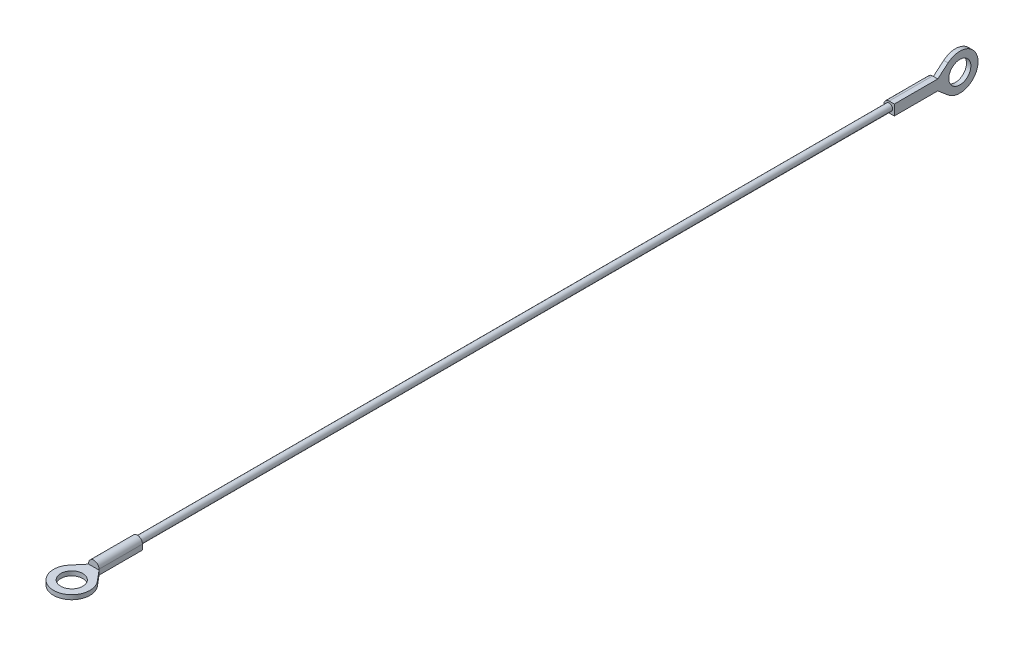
from build123d import *

# Parameters (mm, degrees)
SKETCH1_R           = 0.795
BOSS_EXTRUDE1_DEPTH = 86.52
BOSS_EXTRUDE2_DEPTH = 10
SKETCH3_R           = 2.54
BOSS_EXTRUDE3_DEPTH = 1.01
BOSS_EXTRUDE4_START = 10
BOSS_EXTRUDE4_DEPTH = 10
SKETCH5_R           = 2.54
BOSS_EXTRUDE5_DEPTH = 1.01


with BuildPart() as part:
    # Sketch1 → Boss-Extrude1 (new, symmetric)
    with BuildSketch(Plane.XY):
        Circle(SKETCH1_R)
    extrude(amount=BOSS_EXTRUDE1_DEPTH, both=True)

    # Sketch2 → Boss-Extrude2 (add)
    with BuildSketch(Plane.XY.offset(86.52)):
        with BuildLine():
            Line((-1.195, 0), (-1.195, -1.195))
            Line((-1.195, -1.195), (0, -1.195))
            Line((0, -1.195), (1.195, -1.195))
            Line((1.195, -1.195), (1.195, 0))
            ThreePointArc((1.195, 0), (0, 1.195), (-1.195, 0))
        make_face()
    extrude(amount=BOSS_EXTRUDE2_DEPTH)

    # Sketch3 → Boss-Extrude3 (add)
    with BuildSketch(Plane.XZ.offset(1.195)):
        with BuildLine():
            Line((1.195, 96.52), (3.201749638, 98.897242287))
            ThreePointArc((3.201749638, 98.897242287), (0, 105.79), (-3.201749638, 98.897242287))
            Line((-3.201749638, 98.897242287), (-1.195, 96.52))
            Line((-1.195, 96.52), (1.195, 96.52))
        make_face()
        with Locations(Location((0, 101.6, 0), (0, 0, 270))):
            Circle(SKETCH3_R, mode=Mode.SUBTRACT)
    extrude(amount=-BOSS_EXTRUDE3_DEPTH)

    # Sketch4 → Boss-Extrude4 (add)
    with BuildSketch(Plane(origin=(0, 0, -86.52), x_dir=(-1, 0, 0), z_dir=(0, 0, -1)).offset(BOSS_EXTRUDE4_START)):
        with BuildLine():
            Line((0, 1.195), (-1.195, 1.195))
            Line((-1.195, 1.195), (-1.195, 0))
            Line((-1.195, 0), (-1.195, -1.195))
            Line((-1.195, -1.195), (0, -1.195))
            ThreePointArc((0, -1.195), (1.195, 0), (0, 1.195))
        make_face()
    extrude(amount=-BOSS_EXTRUDE4_DEPTH)

    # Sketch5 → Boss-Extrude5 (add)
    with BuildSketch(Plane(origin=(1.195, 0, 0), x_dir=(0, 0, -1), z_dir=(1, 0, 0))):
        with BuildLine():
            Line((96.52, -1.195), (96.52, 1.195))
            Line((96.52, 1.195), (98.897242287, 3.201749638))
            ThreePointArc((98.897242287, 3.201749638), (105.79, 0), (98.897242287, -3.201749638))
            Line((98.897242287, -3.201749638), (96.52, -1.195))
        make_face()
        with Locations((101.6, 0)):
            Circle(SKETCH5_R, mode=Mode.SUBTRACT)
    extrude(amount=-BOSS_EXTRUDE5_DEPTH)


solid = part.part
